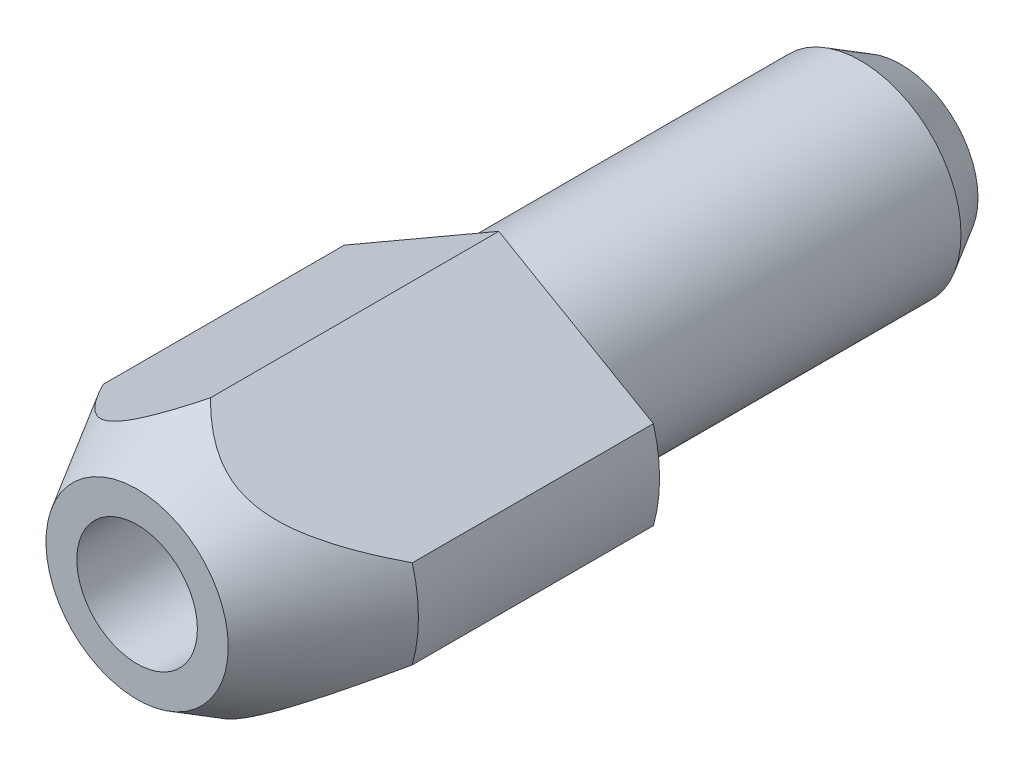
ISO-10303-21;
HEADER;
FILE_DESCRIPTION(('STEP AP214'),'2;1');
FILE_NAME('part.step','',(''),(''),'','','');
FILE_SCHEMA(('AUTOMOTIVE_DESIGN { 1 0 10303 214 1 1 1 1 }'));
ENDSEC;
DATA;
#1=APPLICATION_CONTEXT('core data for automotive mechanical design processes');
#2=APPLICATION_PROTOCOL_DEFINITION('international standard','automotive_design',2000,#1);
#3=PRODUCT_CONTEXT('',#1,'mechanical');
#4=PRODUCT('Part','Part','',(#3));
#5=PRODUCT_RELATED_PRODUCT_CATEGORY('part','',(#4));
#6=PRODUCT_DEFINITION_FORMATION('','',#4);
#7=PRODUCT_DEFINITION_CONTEXT('part definition',#1,'design');
#8=PRODUCT_DEFINITION('design','',#6,#7);
#9=PRODUCT_DEFINITION_SHAPE('','',#8);
#10=(LENGTH_UNIT() NAMED_UNIT(*) SI_UNIT(.MILLI.,.METRE.));
#11=(NAMED_UNIT(*) PLANE_ANGLE_UNIT() SI_UNIT($,.RADIAN.));
#12=(NAMED_UNIT(*) SI_UNIT($,.STERADIAN.) SOLID_ANGLE_UNIT());
#13=UNCERTAINTY_MEASURE_WITH_UNIT(LENGTH_MEASURE(1.E-05),#10,'distance_accuracy_value','');
#14=(GEOMETRIC_REPRESENTATION_CONTEXT(3) GLOBAL_UNCERTAINTY_ASSIGNED_CONTEXT((#13)) GLOBAL_UNIT_ASSIGNED_CONTEXT((#10,
#11,#12)) REPRESENTATION_CONTEXT('',''));
#15=CARTESIAN_POINT('',(0.,0.,0.));
#16=DIRECTION('',(0.,0.,1.));
#17=DIRECTION('',(1.,0.,0.));
#18=AXIS2_PLACEMENT_3D('',#15,#16,#17);
#19=CARTESIAN_POINT('',(2.5,0.,0.));
#20=DIRECTION('',(0.,0.,1.));
#21=DIRECTION('',(1.,0.,0.));
#22=AXIS2_PLACEMENT_3D('',#19,#20,#21);
#23=PLANE('',#22);
#24=CARTESIAN_POINT('',(0.,0.,0.));
#25=DIRECTION('',(0.,0.,1.));
#26=DIRECTION('',(1.,0.,0.));
#27=AXIS2_PLACEMENT_3D('',#24,#25,#26);
#28=CIRCLE('',#27,2.5);
#29=CARTESIAN_POINT('',(2.5,0.,0.));
#30=VERTEX_POINT('',#29);
#31=EDGE_CURVE('E96',#30,#30,#28,.T.);
#32=ORIENTED_EDGE('',*,*,#31,.T.);
#33=EDGE_LOOP('',(#32));
#34=FACE_BOUND('',#33,.T.);
#35=DIRECTION('',(-0.866025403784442,0.5,0.));
#36=VECTOR('',#35,1.);
#37=CARTESIAN_POINT('',(3.84577690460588,1.1,0.));
#38=LINE('',#37,#36);
#39=CARTESIAN_POINT('',(3.84577690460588,1.1,0.));
#40=VERTEX_POINT('',#39);
#41=CARTESIAN_POINT('',(0.,3.32036033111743,0.));
#42=VERTEX_POINT('',#41);
#43=EDGE_CURVE('E79',#40,#42,#38,.T.);
#44=ORIENTED_EDGE('',*,*,#43,.F.);
#45=CARTESIAN_POINT('',(0.,0.,0.));
#46=DIRECTION('',(0.,0.,1.));
#47=DIRECTION('',(1.,0.,0.));
#48=AXIS2_PLACEMENT_3D('',#45,#46,#47);
#49=CIRCLE('',#48,4.);
#50=CARTESIAN_POINT('',(3.84577690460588,-1.1,0.));
#51=VERTEX_POINT('',#50);
#52=EDGE_CURVE('E92',#51,#40,#49,.T.);
#53=ORIENTED_EDGE('',*,*,#52,.F.);
#54=DIRECTION('',(-0.866025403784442,-0.499999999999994,0.));
#55=VECTOR('',#54,1.);
#56=CARTESIAN_POINT('',(3.84577690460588,-1.1,0.));
#57=LINE('',#56,#55);
#58=CARTESIAN_POINT('',(0.,-3.32036033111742,0.));
#59=VERTEX_POINT('',#58);
#60=EDGE_CURVE('E201',#51,#59,#57,.T.);
#61=ORIENTED_EDGE('',*,*,#60,.T.);
#62=DIRECTION('',(0.866025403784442,-0.499999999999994,0.));
#63=VECTOR('',#62,1.);
#64=CARTESIAN_POINT('',(-3.84577690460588,-1.1,0.));
#65=LINE('',#64,#63);
#66=CARTESIAN_POINT('',(-3.84577690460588,-1.1,0.));
#67=VERTEX_POINT('',#66);
#68=EDGE_CURVE('E91',#67,#59,#65,.T.);
#69=ORIENTED_EDGE('',*,*,#68,.F.);
#70=CARTESIAN_POINT('',(-3.84577690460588,1.1,0.));
#71=VERTEX_POINT('',#70);
#72=EDGE_CURVE('E85',#71,#67,#49,.T.);
#73=ORIENTED_EDGE('',*,*,#72,.F.);
#74=DIRECTION('',(0.866025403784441,0.5,0.));
#75=VECTOR('',#74,1.);
#76=CARTESIAN_POINT('',(-3.84577690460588,1.1,0.));
#77=LINE('',#76,#75);
#78=EDGE_CURVE('E71',#71,#42,#77,.T.);
#79=ORIENTED_EDGE('',*,*,#78,.T.);
#80=EDGE_LOOP('',(#44,#53,#61,#69,#73,#79));
#81=FACE_BOUND('',#80,.T.);
#82=ADVANCED_FACE('F14',(#34,#81),#23,.F.);
#83=CARTESIAN_POINT('',(0.,0.,30.));
#84=DIRECTION('',(0.,0.,1.));
#85=DIRECTION('',(1.,0.,0.));
#86=AXIS2_PLACEMENT_3D('',#83,#84,#85);
#87=CYLINDRICAL_SURFACE('',#86,4.);
#88=DIRECTION('',(0.,0.,1.));
#89=VECTOR('',#88,1.);
#90=CARTESIAN_POINT('',(3.84577690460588,1.1,0.));
#91=LINE('',#90,#89);
#92=CARTESIAN_POINT('',(3.84577690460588,1.1,6.));
#93=VERTEX_POINT('',#92);
#94=EDGE_CURVE('E197',#40,#93,#91,.T.);
#95=ORIENTED_EDGE('',*,*,#94,.T.);
#96=CARTESIAN_POINT('',(0.,0.,6.));
#97=DIRECTION('',(0.,0.,1.));
#98=DIRECTION('',(1.,0.,0.));
#99=AXIS2_PLACEMENT_3D('',#96,#97,#98);
#100=CIRCLE('',#99,4.);
#101=CARTESIAN_POINT('',(3.84577690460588,-1.1,6.));
#102=VERTEX_POINT('',#101);
#103=EDGE_CURVE('E93',#102,#93,#100,.T.);
#104=ORIENTED_EDGE('',*,*,#103,.F.);
#105=DIRECTION('',(0.,0.,1.));
#106=VECTOR('',#105,1.);
#107=CARTESIAN_POINT('',(3.84577690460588,-1.1,0.));
#108=LINE('',#107,#106);
#109=EDGE_CURVE('E209',#51,#102,#108,.T.);
#110=ORIENTED_EDGE('',*,*,#109,.F.);
#111=ORIENTED_EDGE('',*,*,#52,.T.);
#112=EDGE_LOOP('',(#95,#104,#110,#111));
#113=FACE_BOUND('',#112,.T.);
#114=ADVANCED_FACE('F150',(#113),#87,.T.);
#115=CARTESIAN_POINT('',(0.,0.,6.));
#116=DIRECTION('',(0.,0.,-1.));
#117=DIRECTION('',(-1.,0.,0.));
#118=AXIS2_PLACEMENT_3D('',#115,#116,#117);
#119=CONICAL_SURFACE('',#118,4.,0.523598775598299);
#120=CARTESIAN_POINT('',(0.,0.,9.));
#121=DIRECTION('',(0.,0.,1.));
#122=DIRECTION('',(1.,0.,0.));
#123=AXIS2_PLACEMENT_3D('',#120,#121,#122);
#124=CIRCLE('',#123,2.26794919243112);
#125=CARTESIAN_POINT('',(2.26794919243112,0.,9.));
#126=VERTEX_POINT('',#125);
#127=EDGE_CURVE('E191',#126,#126,#124,.T.);
#128=ORIENTED_EDGE('',*,*,#127,.F.);
#129=EDGE_LOOP('',(#128));
#130=FACE_BOUND('',#129,.T.);
#131=CARTESIAN_POINT('',(-0.000200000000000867,3.32047580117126,7.17697042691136));
#132=CARTESIAN_POINT('',(0.0599469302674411,3.28574995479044,7.23705153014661));
#133=CARTESIAN_POINT('',(0.121296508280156,3.25032975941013,7.29564443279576));
#134=CARTESIAN_POINT('',(0.247175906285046,3.17765325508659,7.40889178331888));
#135=CARTESIAN_POINT('',(0.311720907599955,3.14038818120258,7.46352362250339));
#136=CARTESIAN_POINT('',(0.445874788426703,3.06293440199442,7.56858241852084));
#137=CARTESIAN_POINT('',(0.515572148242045,3.02269461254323,7.61886122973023));
#138=CARTESIAN_POINT('',(0.658708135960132,2.94005501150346,7.71138962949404));
#139=CARTESIAN_POINT('',(0.732138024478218,2.89766024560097,7.75365696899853));
#140=CARTESIAN_POINT('',(0.889602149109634,2.80674829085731,7.83090442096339));
#141=CARTESIAN_POINT('',(0.974001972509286,2.75802003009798,7.86492266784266));
#142=CARTESIAN_POINT('',(1.14589991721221,2.65877470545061,7.91641835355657));
#143=CARTESIAN_POINT('',(1.23336676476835,2.60827569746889,7.93402982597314));
#144=CARTESIAN_POINT('',(1.41050928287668,2.50600241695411,7.95052812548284));
#145=CARTESIAN_POINT('',(1.50019795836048,2.45422063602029,7.94923837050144));
#146=CARTESIAN_POINT('',(1.67792775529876,2.35160828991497,7.92771802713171));
#147=CARTESIAN_POINT('',(1.76596538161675,2.30077974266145,7.90745106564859));
#148=CARTESIAN_POINT('',(1.96264835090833,2.18722477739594,7.8429265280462));
#149=CARTESIAN_POINT('',(2.06998539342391,2.12525370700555,7.79346498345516));
#150=CARTESIAN_POINT('',(2.22538241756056,2.035535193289,7.70545298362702));
#151=CARTESIAN_POINT('',(2.27650401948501,2.00602012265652,7.67360486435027));
#152=CARTESIAN_POINT('',(2.37684179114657,1.94809008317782,7.60613651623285));
#153=CARTESIAN_POINT('',(2.42605850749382,1.91967479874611,7.57051738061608));
#154=CARTESIAN_POINT('',(2.54275981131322,1.85229726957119,7.48082572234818));
#155=CARTESIAN_POINT('',(2.6093571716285,1.81384726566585,7.42522563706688));
#156=CARTESIAN_POINT('',(2.73951505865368,1.73870057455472,7.30944126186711));
#157=CARTESIAN_POINT('',(2.80307387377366,1.70200487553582,7.24925443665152));
#158=CARTESIAN_POINT('',(2.92779227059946,1.62999867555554,7.12519996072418));
#159=CARTESIAN_POINT('',(2.98894309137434,1.59469323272,7.06132064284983));
#160=CARTESIAN_POINT('',(3.10903494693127,1.52535816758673,6.93084666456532));
#161=CARTESIAN_POINT('',(3.16797568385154,1.49132871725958,6.86425164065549));
#162=CARTESIAN_POINT('',(3.28061212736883,1.4262980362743,6.73285381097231));
#163=CARTESIAN_POINT('',(3.33441367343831,1.39523569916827,6.66817143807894));
#164=CARTESIAN_POINT('',(3.44059159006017,1.33393385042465,6.53725923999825));
#165=CARTESIAN_POINT('',(3.49296784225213,1.30369440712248,6.47102928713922));
#166=CARTESIAN_POINT('',(3.59605151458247,1.2441790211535,6.33786541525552));
#167=CARTESIAN_POINT('',(3.64676928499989,1.2148971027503,6.27094214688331));
#168=CARTESIAN_POINT('',(3.7471341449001,1.15695142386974,6.13606209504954));
#169=CARTESIAN_POINT('',(3.79678150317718,1.12828750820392,6.06810557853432));
#170=CARTESIAN_POINT('',(3.84597690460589,1.09988452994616,5.99972193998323));
#171=B_SPLINE_CURVE_WITH_KNOTS('',3,(#131,#132,#133,#134,#135,#136,#137,#138,#139,#140,#141,
#142,#143,#144,#145,#146,#147,#148,#149,#150,#151,#152,#153,#154,#155,#156,#157,#158,#159,#160,
#161,#162,#163,#164,#165,#166,#167,#168,#169,#170),.UNSPECIFIED.,.F.,.F.,(4,2,2,2,2,2,2,2,2,2,2,
2,2,2,2,2,2,2,2,4),(0.,0.27559059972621,0.552647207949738,0.836981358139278,1.12067795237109,
1.42921005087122,1.73519893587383,2.04404828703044,2.35349081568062,2.75144411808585,
2.95257783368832,3.15365339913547,3.43810443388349,3.72271385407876,4.00827774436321,
4.2938799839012,4.56290017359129,4.83194263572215,5.09871565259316,5.36542088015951),.UNSPECIFIED.);
#172=CARTESIAN_POINT('',(0.,3.32036033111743,7.17717043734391));
#173=VERTEX_POINT('',#172);
#174=EDGE_CURVE('E9',#173,#93,#171,.T.);
#175=ORIENTED_EDGE('',*,*,#174,.F.);
#176=CARTESIAN_POINT('',(0.000199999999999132,3.32047580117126,7.17697042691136));
#177=CARTESIAN_POINT('',(-0.0599469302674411,3.28574995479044,7.23705153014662));
#178=CARTESIAN_POINT('',(-0.121296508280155,3.25032975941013,7.29564443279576));
#179=CARTESIAN_POINT('',(-0.247175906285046,3.17765325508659,7.40889178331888));
#180=CARTESIAN_POINT('',(-0.311720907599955,3.14038818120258,7.46352362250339));
#181=CARTESIAN_POINT('',(-0.445874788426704,3.06293440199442,7.56858241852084));
#182=CARTESIAN_POINT('',(-0.515572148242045,3.02269461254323,7.61886122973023));
#183=CARTESIAN_POINT('',(-0.658708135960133,2.94005501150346,7.71138962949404));
#184=CARTESIAN_POINT('',(-0.73213802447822,2.89766024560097,7.75365696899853));
#185=CARTESIAN_POINT('',(-0.889602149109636,2.80674829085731,7.83090442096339));
#186=CARTESIAN_POINT('',(-0.974001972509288,2.75802003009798,7.86492266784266));
#187=CARTESIAN_POINT('',(-1.14589991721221,2.65877470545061,7.91641835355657));
#188=CARTESIAN_POINT('',(-1.23336676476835,2.60827569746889,7.93402982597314));
#189=CARTESIAN_POINT('',(-1.41050928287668,2.50600241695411,7.95052812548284));
#190=CARTESIAN_POINT('',(-1.50019795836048,2.45422063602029,7.94923837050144));
#191=CARTESIAN_POINT('',(-1.67792775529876,2.35160828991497,7.92771802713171));
#192=CARTESIAN_POINT('',(-1.76596538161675,2.30077974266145,7.90745106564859));
#193=CARTESIAN_POINT('',(-1.96264835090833,2.18722477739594,7.8429265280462));
#194=CARTESIAN_POINT('',(-2.06998539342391,2.12525370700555,7.79346498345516));
#195=CARTESIAN_POINT('',(-2.22538241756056,2.035535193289,7.70545298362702));
#196=CARTESIAN_POINT('',(-2.27650401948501,2.00602012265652,7.67360486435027));
#197=CARTESIAN_POINT('',(-2.37684179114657,1.94809008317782,7.60613651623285));
#198=CARTESIAN_POINT('',(-2.42605850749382,1.91967479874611,7.57051738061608));
#199=CARTESIAN_POINT('',(-2.54275981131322,1.85229726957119,7.48082572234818));
#200=CARTESIAN_POINT('',(-2.6093571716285,1.81384726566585,7.42522563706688));
#201=CARTESIAN_POINT('',(-2.73951505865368,1.73870057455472,7.30944126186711));
#202=CARTESIAN_POINT('',(-2.80307387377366,1.70200487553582,7.24925443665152));
#203=CARTESIAN_POINT('',(-2.92779227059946,1.62999867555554,7.12519996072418));
#204=CARTESIAN_POINT('',(-2.98894309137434,1.59469323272,7.06132064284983));
#205=CARTESIAN_POINT('',(-3.10903494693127,1.52535816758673,6.93084666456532));
#206=CARTESIAN_POINT('',(-3.16797568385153,1.49132871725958,6.86425164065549));
#207=CARTESIAN_POINT('',(-3.28061212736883,1.42629803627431,6.73285381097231));
#208=CARTESIAN_POINT('',(-3.33441367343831,1.39523569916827,6.66817143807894));
#209=CARTESIAN_POINT('',(-3.44059159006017,1.33393385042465,6.53725923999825));
#210=CARTESIAN_POINT('',(-3.49296784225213,1.30369440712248,6.47102928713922));
#211=CARTESIAN_POINT('',(-3.59605151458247,1.2441790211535,6.33786541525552));
#212=CARTESIAN_POINT('',(-3.64676928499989,1.2148971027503,6.27094214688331));
#213=CARTESIAN_POINT('',(-3.7471341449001,1.15695142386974,6.13606209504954));
#214=CARTESIAN_POINT('',(-3.79678150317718,1.12828750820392,6.06810557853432));
#215=CARTESIAN_POINT('',(-3.84597690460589,1.09988452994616,5.99972193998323));
#216=B_SPLINE_CURVE_WITH_KNOTS('',3,(#176,#177,#178,#179,#180,#181,#182,#183,#184,#185,#186,
#187,#188,#189,#190,#191,#192,#193,#194,#195,#196,#197,#198,#199,#200,#201,#202,#203,#204,#205,
#206,#207,#208,#209,#210,#211,#212,#213,#214,#215),.UNSPECIFIED.,.F.,.F.,(4,2,2,2,2,2,2,2,2,2,2,
2,2,2,2,2,2,2,2,4),(0.,0.275590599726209,0.552647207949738,0.836981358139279,1.12067795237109,
1.42921005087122,1.73519893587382,2.04404828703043,2.35349081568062,2.75144411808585,
2.95257783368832,3.15365339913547,3.43810443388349,3.72271385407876,4.00827774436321,
4.2938799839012,4.56290017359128,4.83194263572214,5.09871565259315,5.36542088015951),.UNSPECIFIED.);
#217=CARTESIAN_POINT('',(-3.84577690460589,1.1,6.));
#218=VERTEX_POINT('',#217);
#219=EDGE_CURVE('E28',#173,#218,#216,.T.);
#220=ORIENTED_EDGE('',*,*,#219,.T.);
#221=CARTESIAN_POINT('',(-3.84577690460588,-1.1,6.));
#222=VERTEX_POINT('',#221);
#223=EDGE_CURVE('E87',#218,#222,#100,.T.);
#224=ORIENTED_EDGE('',*,*,#223,.T.);
#225=CARTESIAN_POINT('',(0.000200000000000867,-3.32047580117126,7.17697042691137));
#226=CARTESIAN_POINT('',(-0.0599469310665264,-3.28574995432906,7.2370515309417));
#227=CARTESIAN_POINT('',(-0.121296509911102,-3.25032975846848,7.29564443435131));
#228=CARTESIAN_POINT('',(-0.247175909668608,-3.17765325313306,7.40889178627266));
#229=CARTESIAN_POINT('',(-0.311720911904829,-3.14038817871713,7.46352362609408));
#230=CARTESIAN_POINT('',(-0.445874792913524,-3.06293439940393,7.56858242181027));
#231=CARTESIAN_POINT('',(-0.515572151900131,-3.0226946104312,7.61886123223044));
#232=CARTESIAN_POINT('',(-0.658708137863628,-2.94005501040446,7.71138963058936));
#233=CARTESIAN_POINT('',(-0.732138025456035,-2.89766024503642,7.75365696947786));
#234=CARTESIAN_POINT('',(-0.88960214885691,-2.80674829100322,7.8309044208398));
#235=CARTESIAN_POINT('',(-0.974001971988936,-2.75802003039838,7.86492266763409));
#236=CARTESIAN_POINT('',(-1.14589991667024,-2.6587747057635,7.91641835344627));
#237=CARTESIAN_POINT('',(-1.23336676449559,-2.60827569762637,7.93402982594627));
#238=CARTESIAN_POINT('',(-1.41050928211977,-2.50600241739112,7.95052812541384));
#239=CARTESIAN_POINT('',(-1.5001979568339,-2.45422063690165,7.94923837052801));
#240=CARTESIAN_POINT('',(-1.67792775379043,-2.35160829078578,7.92771802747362));
#241=CARTESIAN_POINT('',(-1.76596538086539,-2.30077974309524,7.90745106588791));
#242=CARTESIAN_POINT('',(-1.96264836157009,-2.18722477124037,7.84292652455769));
#243=CARTESIAN_POINT('',(-2.0699854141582,-2.1252536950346,7.79346497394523));
#244=CARTESIAN_POINT('',(-2.22538244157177,-2.03553517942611,7.70545296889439));
#245=CARTESIAN_POINT('',(-2.27650403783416,-2.00602011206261,7.67360485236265));
#246=CARTESIAN_POINT('',(-2.37684179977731,-1.94809007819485,7.60613651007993));
#247=CARTESIAN_POINT('',(-2.42605851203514,-1.91967479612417,7.57051737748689));
#248=CARTESIAN_POINT('',(-2.54275655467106,-1.85229914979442,7.48082822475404));
#249=CARTESIAN_POINT('',(-2.60935082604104,-1.81385092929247,7.42523093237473));
#250=CARTESIAN_POINT('',(-2.73950279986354,-1.73870765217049,7.30945251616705));
#251=CARTESIAN_POINT('',(-2.8030587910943,-1.7020135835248,7.24926885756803));
#252=CARTESIAN_POINT('',(-2.92777171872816,-1.63001054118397,7.1252209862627));
#253=CARTESIAN_POINT('',(-2.98891989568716,-1.59470662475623,7.06134510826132));
#254=CARTESIAN_POINT('',(-3.10900662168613,-1.52537452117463,6.93087817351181));
#255=CARTESIAN_POINT('',(-3.16794487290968,-1.49134650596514,6.86428675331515));
#256=CARTESIAN_POINT('',(-3.28057681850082,-1.42631842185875,6.7328957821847));
#257=CARTESIAN_POINT('',(-3.33437633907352,-1.39525725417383,6.66821665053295));
#258=CARTESIAN_POINT('',(-3.44055027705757,-1.33395770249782,6.53731099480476));
#259=CARTESIAN_POINT('',(-3.49292457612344,-1.30371938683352,6.47108434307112));
#260=CARTESIAN_POINT('',(-3.59600445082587,-1.24420619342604,6.33792704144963));
#261=CARTESIAN_POINT('',(-3.64672037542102,-1.21492534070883,6.27100704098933));
#262=CARTESIAN_POINT('',(-3.74708158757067,-1.15698176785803,6.13613355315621));
#263=CARTESIAN_POINT('',(-3.79672714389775,-1.12831889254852,6.06818033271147));
#264=CARTESIAN_POINT('',(-3.8459207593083,-1.09991694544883,5.9998));
#265=B_SPLINE_CURVE_WITH_KNOTS('',3,(#225,#226,#227,#228,#229,#230,#231,#232,#233,#234,#235,
#236,#237,#238,#239,#240,#241,#242,#243,#244,#245,#246,#247,#248,#249,#250,#251,#252,#253,#254,
#255,#256,#257,#258,#259,#260,#261,#262,#263,#264),.UNSPECIFIED.,.F.,.F.,(4,2,2,2,2,2,2,2,2,2,2,
2,2,2,2,2,2,2,2,4),(0.,0.275590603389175,0.552647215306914,0.836981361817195,1.12067795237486,
1.42921004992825,1.73519893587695,2.04404828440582,2.35349081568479,2.75144415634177,
2.9525778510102,3.15365339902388,3.43809088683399,3.72268673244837,4.00823691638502,
4.2938254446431,4.56283376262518,4.83186435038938,5.09862577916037,5.36531942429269),.UNSPECIFIED.);
#266=CARTESIAN_POINT('',(0.,-3.32036033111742,7.17717043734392));
#267=VERTEX_POINT('',#266);
#268=EDGE_CURVE('E115',#267,#222,#265,.T.);
#269=ORIENTED_EDGE('',*,*,#268,.F.);
#270=CARTESIAN_POINT('',(-0.000199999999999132,-3.32047580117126,7.17697042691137));
#271=CARTESIAN_POINT('',(0.059946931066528,-3.28574995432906,7.2370515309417));
#272=CARTESIAN_POINT('',(0.121296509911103,-3.25032975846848,7.29564443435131));
#273=CARTESIAN_POINT('',(0.247175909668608,-3.17765325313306,7.40889178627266));
#274=CARTESIAN_POINT('',(0.31172091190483,-3.14038817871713,7.46352362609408));
#275=CARTESIAN_POINT('',(0.445874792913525,-3.06293439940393,7.56858242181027));
#276=CARTESIAN_POINT('',(0.515572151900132,-3.0226946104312,7.61886123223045));
#277=CARTESIAN_POINT('',(0.658708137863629,-2.94005501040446,7.71138963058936));
#278=CARTESIAN_POINT('',(0.732138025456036,-2.89766024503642,7.75365696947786));
#279=CARTESIAN_POINT('',(0.88960214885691,-2.80674829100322,7.8309044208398));
#280=CARTESIAN_POINT('',(0.974001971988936,-2.75802003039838,7.86492266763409));
#281=CARTESIAN_POINT('',(1.14589991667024,-2.6587747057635,7.91641835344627));
#282=CARTESIAN_POINT('',(1.23336676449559,-2.60827569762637,7.93402982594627));
#283=CARTESIAN_POINT('',(1.41050928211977,-2.50600241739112,7.95052812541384));
#284=CARTESIAN_POINT('',(1.5001979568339,-2.45422063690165,7.94923837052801));
#285=CARTESIAN_POINT('',(1.67792775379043,-2.35160829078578,7.92771802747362));
#286=CARTESIAN_POINT('',(1.76596538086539,-2.30077974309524,7.90745106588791));
#287=CARTESIAN_POINT('',(1.96264836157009,-2.18722477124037,7.84292652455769));
#288=CARTESIAN_POINT('',(2.0699854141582,-2.1252536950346,7.79346497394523));
#289=CARTESIAN_POINT('',(2.22538244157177,-2.03553517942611,7.70545296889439));
#290=CARTESIAN_POINT('',(2.27650403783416,-2.00602011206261,7.67360485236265));
#291=CARTESIAN_POINT('',(2.37684179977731,-1.94809007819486,7.60613651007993));
#292=CARTESIAN_POINT('',(2.42605851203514,-1.91967479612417,7.57051737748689));
#293=CARTESIAN_POINT('',(2.54275655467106,-1.85229914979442,7.48082822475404));
#294=CARTESIAN_POINT('',(2.60935082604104,-1.81385092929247,7.42523093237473));
#295=CARTESIAN_POINT('',(2.73950279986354,-1.73870765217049,7.30945251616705));
#296=CARTESIAN_POINT('',(2.8030587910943,-1.7020135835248,7.24926885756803));
#297=CARTESIAN_POINT('',(2.92777171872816,-1.63001054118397,7.12522098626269));
#298=CARTESIAN_POINT('',(2.98891989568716,-1.59470662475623,7.06134510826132));
#299=CARTESIAN_POINT('',(3.10900662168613,-1.52537452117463,6.93087817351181));
#300=CARTESIAN_POINT('',(3.16794487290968,-1.49134650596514,6.86428675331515));
#301=CARTESIAN_POINT('',(3.28057681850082,-1.42631842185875,6.7328957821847));
#302=CARTESIAN_POINT('',(3.33437633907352,-1.39525725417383,6.66821665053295));
#303=CARTESIAN_POINT('',(3.44055027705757,-1.33395770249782,6.53731099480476));
#304=CARTESIAN_POINT('',(3.49292457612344,-1.30371938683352,6.47108434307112));
#305=CARTESIAN_POINT('',(3.59600445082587,-1.24420619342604,6.33792704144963));
#306=CARTESIAN_POINT('',(3.64672037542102,-1.21492534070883,6.27100704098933));
#307=CARTESIAN_POINT('',(3.74708158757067,-1.15698176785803,6.13613355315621));
#308=CARTESIAN_POINT('',(3.79672714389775,-1.12831889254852,6.06818033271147));
#309=CARTESIAN_POINT('',(3.8459207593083,-1.09991694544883,5.9998));
#310=B_SPLINE_CURVE_WITH_KNOTS('',3,(#270,#271,#272,#273,#274,#275,#276,#277,#278,#279,#280,
#281,#282,#283,#284,#285,#286,#287,#288,#289,#290,#291,#292,#293,#294,#295,#296,#297,#298,#299,
#300,#301,#302,#303,#304,#305,#306,#307,#308,#309),.UNSPECIFIED.,.F.,.F.,(4,2,2,2,2,2,2,2,2,2,2,
2,2,2,2,2,2,2,2,4),(0.,0.275590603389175,0.552647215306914,0.836981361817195,1.12067795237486,
1.42921004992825,1.73519893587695,2.04404828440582,2.35349081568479,2.75144415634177,
2.95257785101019,3.15365339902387,3.43809088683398,3.72268673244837,4.00823691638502,
4.2938254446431,4.56283376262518,4.83186435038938,5.09862577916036,5.36531942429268),.UNSPECIFIED.);
#311=EDGE_CURVE('E122',#267,#102,#310,.T.);
#312=ORIENTED_EDGE('',*,*,#311,.T.);
#313=ORIENTED_EDGE('',*,*,#103,.T.);
#314=EDGE_LOOP('',(#175,#220,#224,#269,#312,#313));
#315=FACE_BOUND('',#314,.T.);
#316=ADVANCED_FACE('F128',(#130,#315),#119,.T.);
#317=CARTESIAN_POINT('',(0.,0.,-6.));
#318=DIRECTION('',(0.,0.,1.));
#319=DIRECTION('',(1.,0.,0.));
#320=AXIS2_PLACEMENT_3D('',#317,#318,#319);
#321=PLANE('',#320);
#322=CARTESIAN_POINT('',(0.,0.,-6.));
#323=DIRECTION('',(0.,0.,1.));
#324=DIRECTION('',(1.,0.,0.));
#325=AXIS2_PLACEMENT_3D('',#322,#323,#324);
#326=CIRCLE('',#325,1.);
#327=CARTESIAN_POINT('',(1.,0.,-6.));
#328=VERTEX_POINT('',#327);
#329=EDGE_CURVE('E112',#328,#328,#326,.T.);
#330=ORIENTED_EDGE('',*,*,#329,.F.);
#331=EDGE_LOOP('',(#330));
#332=FACE_BOUND('',#331,.T.);
#333=ADVANCED_FACE('F16',(#332),#321,.F.);
#334=CARTESIAN_POINT('',(0.,0.,30.));
#335=DIRECTION('',(0.,0.,1.));
#336=DIRECTION('',(1.,0.,0.));
#337=AXIS2_PLACEMENT_3D('',#334,#335,#336);
#338=CYLINDRICAL_SURFACE('',#337,1.);
#339=CARTESIAN_POINT('',(0.,0.,-10.));
#340=DIRECTION('',(0.,0.,1.));
#341=DIRECTION('',(1.,0.,0.));
#342=AXIS2_PLACEMENT_3D('',#339,#340,#341);
#343=CIRCLE('',#342,1.);
#344=CARTESIAN_POINT('',(1.,0.,-10.));
#345=VERTEX_POINT('',#344);
#346=EDGE_CURVE('E109',#345,#345,#343,.T.);
#347=ORIENTED_EDGE('',*,*,#346,.F.);
#348=EDGE_LOOP('',(#347));
#349=FACE_BOUND('',#348,.T.);
#350=ORIENTED_EDGE('',*,*,#329,.T.);
#351=EDGE_LOOP('',(#350));
#352=FACE_BOUND('',#351,.T.);
#353=ADVANCED_FACE('F170',(#349,#352),#338,.F.);
#354=CARTESIAN_POINT('',(1.,0.,-10.));
#355=DIRECTION('',(0.,0.,1.));
#356=DIRECTION('',(1.,0.,0.));
#357=AXIS2_PLACEMENT_3D('',#354,#355,#356);
#358=PLANE('',#357);
#359=CARTESIAN_POINT('',(0.,0.,-10.));
#360=DIRECTION('',(0.,0.,1.));
#361=DIRECTION('',(1.,0.,0.));
#362=AXIS2_PLACEMENT_3D('',#359,#360,#361);
#363=CIRCLE('',#362,1.92264973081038);
#364=CARTESIAN_POINT('',(1.92264973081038,0.,-10.));
#365=VERTEX_POINT('',#364);
#366=EDGE_CURVE('E106',#365,#365,#363,.T.);
#367=ORIENTED_EDGE('',*,*,#366,.F.);
#368=EDGE_LOOP('',(#367));
#369=FACE_BOUND('',#368,.T.);
#370=ORIENTED_EDGE('',*,*,#346,.T.);
#371=EDGE_LOOP('',(#370));
#372=FACE_BOUND('',#371,.T.);
#373=ADVANCED_FACE('F167',(#369,#372),#358,.F.);
#374=CARTESIAN_POINT('',(0.,0.,-9.));
#375=DIRECTION('',(0.,0.,1.));
#376=DIRECTION('',(1.,0.,0.));
#377=AXIS2_PLACEMENT_3D('',#374,#375,#376);
#378=CONICAL_SURFACE('',#377,2.5,0.523598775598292);
#379=ORIENTED_EDGE('',*,*,#366,.T.);
#380=EDGE_LOOP('',(#379));
#381=FACE_BOUND('',#380,.T.);
#382=CARTESIAN_POINT('',(0.,0.,-9.));
#383=DIRECTION('',(0.,0.,1.));
#384=DIRECTION('',(1.,0.,0.));
#385=AXIS2_PLACEMENT_3D('',#382,#383,#384);
#386=CIRCLE('',#385,2.5);
#387=CARTESIAN_POINT('',(2.5,0.,-9.));
#388=VERTEX_POINT('',#387);
#389=EDGE_CURVE('E103',#388,#388,#386,.T.);
#390=ORIENTED_EDGE('',*,*,#389,.F.);
#391=EDGE_LOOP('',(#390));
#392=FACE_BOUND('',#391,.T.);
#393=ADVANCED_FACE('F163',(#381,#392),#378,.T.);
#394=CARTESIAN_POINT('',(0.,0.,30.));
#395=DIRECTION('',(0.,0.,1.));
#396=DIRECTION('',(1.,0.,0.));
#397=AXIS2_PLACEMENT_3D('',#394,#395,#396);
#398=CYLINDRICAL_SURFACE('',#397,2.5);
#399=ORIENTED_EDGE('',*,*,#31,.F.);
#400=EDGE_LOOP('',(#399));
#401=FACE_BOUND('',#400,.T.);
#402=ORIENTED_EDGE('',*,*,#389,.T.);
#403=EDGE_LOOP('',(#402));
#404=FACE_BOUND('',#403,.T.);
#405=ADVANCED_FACE('F149',(#401,#404),#398,.T.);
#406=ORIENTED_EDGE('',*,*,#223,.F.);
#407=DIRECTION('',(0.,0.,1.));
#408=VECTOR('',#407,1.);
#409=CARTESIAN_POINT('',(-3.84577690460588,1.1,0.));
#410=LINE('',#409,#408);
#411=EDGE_CURVE('E35',#71,#218,#410,.T.);
#412=ORIENTED_EDGE('',*,*,#411,.F.);
#413=ORIENTED_EDGE('',*,*,#72,.T.);
#414=DIRECTION('',(0.,0.,1.));
#415=VECTOR('',#414,1.);
#416=CARTESIAN_POINT('',(-3.84577690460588,-1.1,0.));
#417=LINE('',#416,#415);
#418=EDGE_CURVE('E207',#67,#222,#417,.T.);
#419=ORIENTED_EDGE('',*,*,#418,.T.);
#420=EDGE_LOOP('',(#406,#412,#413,#419));
#421=FACE_BOUND('',#420,.T.);
#422=ADVANCED_FACE('F83',(#421),#87,.T.);
#423=CARTESIAN_POINT('',(2.26794919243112,0.,9.));
#424=DIRECTION('',(0.,0.,-1.));
#425=DIRECTION('',(-1.,0.,0.));
#426=AXIS2_PLACEMENT_3D('',#423,#424,#425);
#427=PLANE('',#426);
#428=CARTESIAN_POINT('',(0.,0.,9.));
#429=DIRECTION('',(0.,0.,1.));
#430=DIRECTION('',(1.,0.,0.));
#431=AXIS2_PLACEMENT_3D('',#428,#429,#430);
#432=CIRCLE('',#431,1.5);
#433=CARTESIAN_POINT('',(1.5,0.,9.));
#434=VERTEX_POINT('',#433);
#435=EDGE_CURVE('E211',#434,#434,#432,.T.);
#436=ORIENTED_EDGE('',*,*,#435,.F.);
#437=EDGE_LOOP('',(#436));
#438=FACE_BOUND('',#437,.T.);
#439=ORIENTED_EDGE('',*,*,#127,.T.);
#440=EDGE_LOOP('',(#439));
#441=FACE_BOUND('',#440,.T.);
#442=ADVANCED_FACE('F141',(#438,#441),#427,.F.);
#443=CARTESIAN_POINT('',(0.,0.,30.));
#444=DIRECTION('',(0.,0.,1.));
#445=DIRECTION('',(1.,0.,0.));
#446=AXIS2_PLACEMENT_3D('',#443,#444,#445);
#447=CYLINDRICAL_SURFACE('',#446,1.5);
#448=CARTESIAN_POINT('',(0.,0.,4.5));
#449=DIRECTION('',(0.,0.,1.));
#450=DIRECTION('',(1.,0.,0.));
#451=AXIS2_PLACEMENT_3D('',#448,#449,#450);
#452=CIRCLE('',#451,1.5);
#453=CARTESIAN_POINT('',(1.5,0.,4.5));
#454=VERTEX_POINT('',#453);
#455=EDGE_CURVE('E324',#454,#454,#452,.T.);
#456=ORIENTED_EDGE('',*,*,#455,.F.);
#457=EDGE_LOOP('',(#456));
#458=FACE_BOUND('',#457,.T.);
#459=ORIENTED_EDGE('',*,*,#435,.T.);
#460=EDGE_LOOP('',(#459));
#461=FACE_BOUND('',#460,.T.);
#462=ADVANCED_FACE('F139',(#458,#461),#447,.F.);
#463=CARTESIAN_POINT('',(3.84577690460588,-1.1,0.));
#464=DIRECTION('',(-0.499999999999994,0.866025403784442,0.));
#465=DIRECTION('',(-0.866025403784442,-0.5,0.));
#466=AXIS2_PLACEMENT_3D('',#463,#464,#465);
#467=PLANE('',#466);
#468=DIRECTION('',(0.,0.,1.));
#469=VECTOR('',#468,1.);
#470=CARTESIAN_POINT('',(0.,-3.32036033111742,0.));
#471=LINE('',#470,#469);
#472=EDGE_CURVE('E43',#59,#267,#471,.T.);
#473=ORIENTED_EDGE('',*,*,#472,.F.);
#474=ORIENTED_EDGE('',*,*,#60,.F.);
#475=ORIENTED_EDGE('',*,*,#109,.T.);
#476=ORIENTED_EDGE('',*,*,#311,.F.);
#477=EDGE_LOOP('',(#473,#474,#475,#476));
#478=FACE_BOUND('',#477,.T.);
#479=ADVANCED_FACE('F137',(#478),#467,.F.);
#480=CARTESIAN_POINT('',(-3.84577690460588,-1.1,0.));
#481=DIRECTION('',(-0.499999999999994,-0.866025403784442,0.));
#482=DIRECTION('',(0.866025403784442,-0.499999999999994,0.));
#483=AXIS2_PLACEMENT_3D('',#480,#481,#482);
#484=PLANE('',#483);
#485=ORIENTED_EDGE('',*,*,#268,.T.);
#486=ORIENTED_EDGE('',*,*,#418,.F.);
#487=ORIENTED_EDGE('',*,*,#68,.T.);
#488=ORIENTED_EDGE('',*,*,#472,.T.);
#489=EDGE_LOOP('',(#485,#486,#487,#488));
#490=FACE_BOUND('',#489,.T.);
#491=ADVANCED_FACE('F132',(#490),#484,.T.);
#492=CARTESIAN_POINT('',(3.84577690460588,1.1,0.));
#493=DIRECTION('',(0.5,0.866025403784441,0.));
#494=DIRECTION('',(-0.866025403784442,0.5,0.));
#495=AXIS2_PLACEMENT_3D('',#492,#493,#494);
#496=PLANE('',#495);
#497=ORIENTED_EDGE('',*,*,#174,.T.);
#498=ORIENTED_EDGE('',*,*,#94,.F.);
#499=ORIENTED_EDGE('',*,*,#43,.T.);
#500=DIRECTION('',(0.,0.,1.));
#501=VECTOR('',#500,1.);
#502=CARTESIAN_POINT('',(0.,3.32036033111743,0.));
#503=LINE('',#502,#501);
#504=EDGE_CURVE('E74',#42,#173,#503,.T.);
#505=ORIENTED_EDGE('',*,*,#504,.T.);
#506=EDGE_LOOP('',(#497,#498,#499,#505));
#507=FACE_BOUND('',#506,.T.);
#508=ADVANCED_FACE('F136',(#507),#496,.T.);
#509=CARTESIAN_POINT('',(-3.84577690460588,1.1,0.));
#510=DIRECTION('',(0.5,-0.866025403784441,0.));
#511=DIRECTION('',(0.866025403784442,0.5,0.));
#512=AXIS2_PLACEMENT_3D('',#509,#510,#511);
#513=PLANE('',#512);
#514=ORIENTED_EDGE('',*,*,#504,.F.);
#515=ORIENTED_EDGE('',*,*,#78,.F.);
#516=ORIENTED_EDGE('',*,*,#411,.T.);
#517=ORIENTED_EDGE('',*,*,#219,.F.);
#518=EDGE_LOOP('',(#514,#515,#516,#517));
#519=FACE_BOUND('',#518,.T.);
#520=ADVANCED_FACE('F72',(#519),#513,.F.);
#521=CARTESIAN_POINT('',(0.,0.,4.5));
#522=DIRECTION('',(0.,0.,1.));
#523=DIRECTION('',(1.,0.,0.));
#524=AXIS2_PLACEMENT_3D('',#521,#522,#523);
#525=PLANE('',#524);
#526=ORIENTED_EDGE('',*,*,#455,.T.);
#527=EDGE_LOOP('',(#526));
#528=FACE_BOUND('',#527,.T.);
#529=ADVANCED_FACE('F223',(#528),#525,.T.);
#530=CLOSED_SHELL('',(#82,#114,#316,#333,#353,#373,#393,#405,#422,#442,#462,#479,#491,#508,#520,#529));
#531=MANIFOLD_SOLID_BREP('B1',#530);
#532=ADVANCED_BREP_SHAPE_REPRESENTATION('',(#18,#531),#14);
#533=SHAPE_DEFINITION_REPRESENTATION(#9,#532);
ENDSEC;
END-ISO-10303-21;
